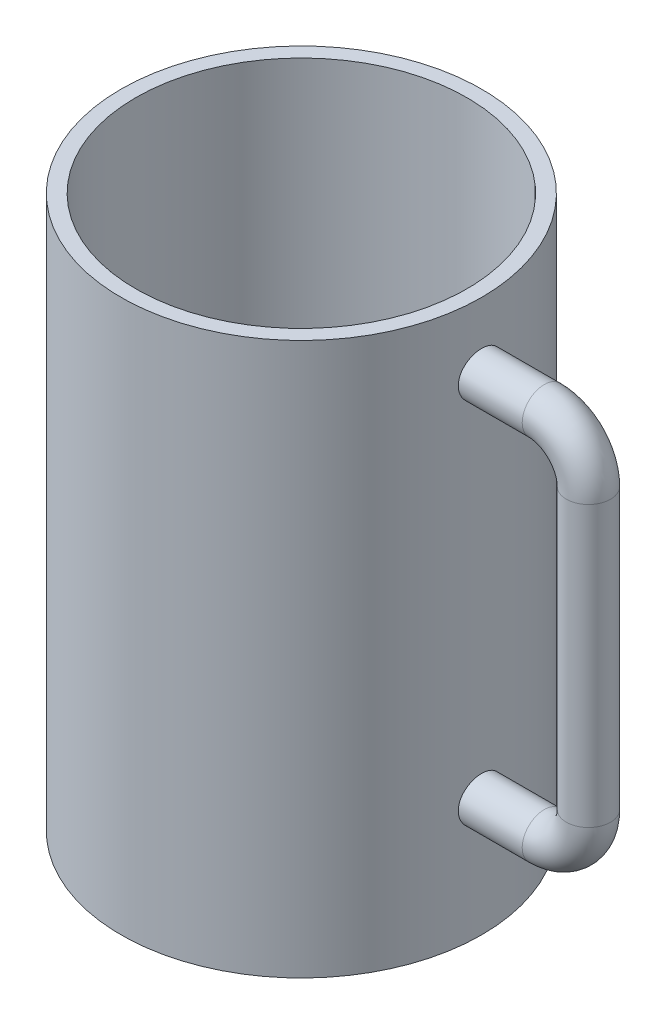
from build123d import *

# Parameters (mm, degrees)
SKETCH2_R = 6


with BuildPart() as part:
    # Sketch1 → Revolve1 (revolve)
    with BuildSketch(Plane.XY, mode=Mode.PRIVATE) as revolve1_sk:
        Polygon((10, -12), (10, -20), (59, -20), (59, 130), (55, 130), (55, -12), align=None)
    revolve(revolve1_sk.sketch.rotate(Axis((10, -12, 0), (0, -1, 0)), 180), axis=Axis((10, -12, 0), (0, -1, 0)))

    # Sweep1: sweep along a path in Sketch3
    with BuildLine(Plane.XY) as sweep1_path:
        Line((56, 112), (76, 112))
        ThreePointArc((76, 112), (84.485281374, 108.485281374), (88, 100))
        Line((88, 100), (88, 24))
        ThreePointArc((88, 24), (84.485281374, 15.514718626), (76, 12))
        Line((76, 12), (56, 12))
    # Sketch2 → Sweep1 (sweep)
    with BuildSketch(Plane(origin=(56, 0, 0), x_dir=(0, 0, -1), z_dir=(1, 0, 0))):
        with Locations((0, 112)):
            Circle(SKETCH2_R)
    sweep(path=sweep1_path.line)


solid = part.part
